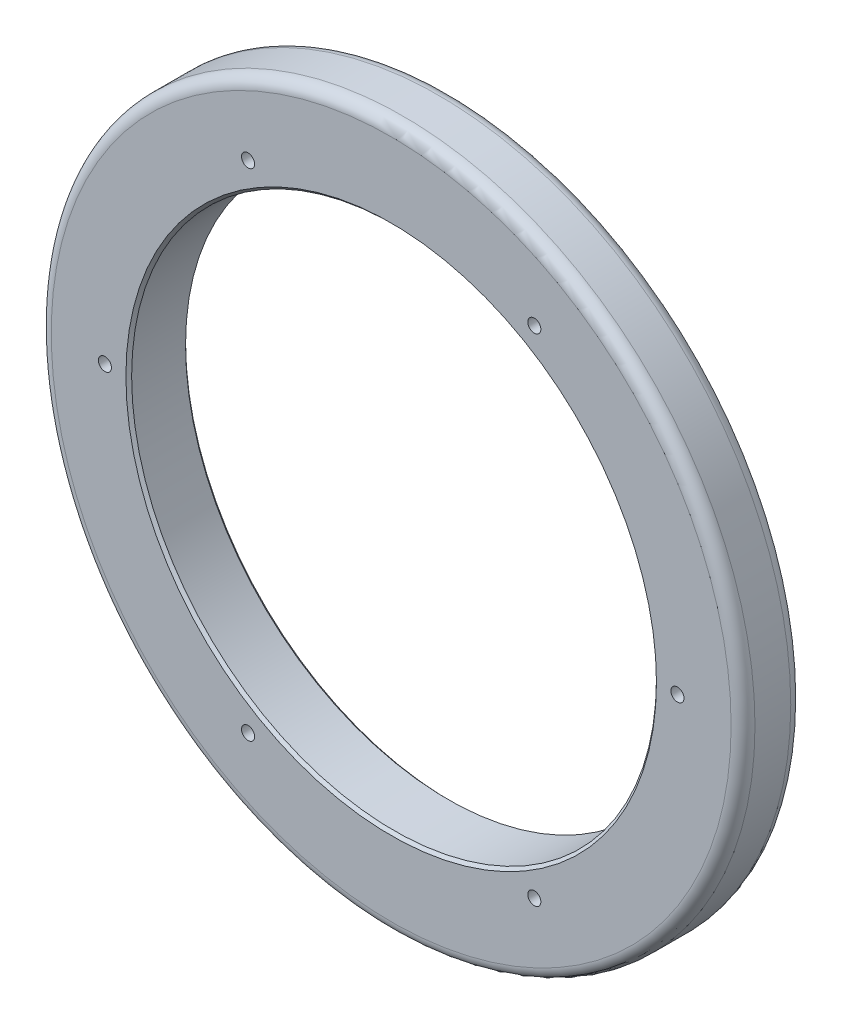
ISO-10303-21;
HEADER;
FILE_DESCRIPTION(('STEP AP214'),'2;1');
FILE_NAME('part.step','',(''),(''),'','','');
FILE_SCHEMA(('AUTOMOTIVE_DESIGN { 1 0 10303 214 1 1 1 1 }'));
ENDSEC;
DATA;
#1=APPLICATION_CONTEXT('core data for automotive mechanical design processes');
#2=APPLICATION_PROTOCOL_DEFINITION('international standard','automotive_design',2000,#1);
#3=PRODUCT_CONTEXT('',#1,'mechanical');
#4=PRODUCT('Part','Part','',(#3));
#5=PRODUCT_RELATED_PRODUCT_CATEGORY('part','',(#4));
#6=PRODUCT_DEFINITION_FORMATION('','',#4);
#7=PRODUCT_DEFINITION_CONTEXT('part definition',#1,'design');
#8=PRODUCT_DEFINITION('design','',#6,#7);
#9=PRODUCT_DEFINITION_SHAPE('','',#8);
#10=(LENGTH_UNIT() NAMED_UNIT(*) SI_UNIT(.MILLI.,.METRE.));
#11=(NAMED_UNIT(*) PLANE_ANGLE_UNIT() SI_UNIT($,.RADIAN.));
#12=(NAMED_UNIT(*) SI_UNIT($,.STERADIAN.) SOLID_ANGLE_UNIT());
#13=UNCERTAINTY_MEASURE_WITH_UNIT(LENGTH_MEASURE(1.E-05),#10,'distance_accuracy_value','');
#14=(GEOMETRIC_REPRESENTATION_CONTEXT(3) GLOBAL_UNCERTAINTY_ASSIGNED_CONTEXT((#13)) GLOBAL_UNIT_ASSIGNED_CONTEXT((#10,
#11,#12)) REPRESENTATION_CONTEXT('',''));
#15=CARTESIAN_POINT('',(0.,0.,0.));
#16=DIRECTION('',(0.,0.,1.));
#17=DIRECTION('',(1.,0.,0.));
#18=AXIS2_PLACEMENT_3D('',#15,#16,#17);
#19=CARTESIAN_POINT('',(0.,0.,15.875));
#20=DIRECTION('',(0.,0.,0.999999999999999));
#21=DIRECTION('',(1.,0.,0.));
#22=AXIS2_PLACEMENT_3D('',#19,#20,#21);
#23=PLANE('',#22);
#24=CARTESIAN_POINT('',(0.,0.,15.875));
#25=DIRECTION('',(0.,0.,0.999999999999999));
#26=DIRECTION('',(1.,0.,0.));
#27=AXIS2_PLACEMENT_3D('',#24,#25,#26);
#28=CIRCLE('',#27,70.612);
#29=CARTESIAN_POINT('',(70.612,0.,15.875));
#30=VERTEX_POINT('',#29);
#31=EDGE_CURVE('E10',#30,#30,#28,.F.);
#32=ORIENTED_EDGE('',*,*,#31,.T.);
#33=EDGE_LOOP('',(#32));
#34=FACE_BOUND('',#33,.T.);
#35=CARTESIAN_POINT('',(-76.2,5.3210206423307E-13,15.875));
#36=DIRECTION('',(0.,0.,0.999999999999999));
#37=DIRECTION('',(1.,0.,0.));
#38=AXIS2_PLACEMENT_3D('',#35,#36,#37);
#39=CIRCLE('',#38,1.7399);
#40=CARTESIAN_POINT('',(-74.4601,5.3210206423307E-13,15.875));
#41=VERTEX_POINT('',#40);
#42=EDGE_CURVE('E96',#41,#41,#39,.T.);
#43=ORIENTED_EDGE('',*,*,#42,.F.);
#44=EDGE_LOOP('',(#43));
#45=FACE_BOUND('',#44,.T.);
#46=CARTESIAN_POINT('',(-38.1000000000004,-65.9911357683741,15.875));
#47=DIRECTION('',(0.,0.,0.999999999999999));
#48=DIRECTION('',(1.,0.,0.));
#49=AXIS2_PLACEMENT_3D('',#46,#47,#48);
#50=CIRCLE('',#49,1.7399);
#51=CARTESIAN_POINT('',(-36.3601000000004,-65.9911357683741,15.875));
#52=VERTEX_POINT('',#51);
#53=EDGE_CURVE('E90',#52,#52,#50,.T.);
#54=ORIENTED_EDGE('',*,*,#53,.F.);
#55=EDGE_LOOP('',(#54));
#56=FACE_BOUND('',#55,.T.);
#57=CARTESIAN_POINT('',(38.0999999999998,-65.9911357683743,15.875));
#58=DIRECTION('',(0.,0.,0.999999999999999));
#59=DIRECTION('',(1.,0.,0.));
#60=AXIS2_PLACEMENT_3D('',#57,#58,#59);
#61=CIRCLE('',#60,1.7399);
#62=CARTESIAN_POINT('',(39.8398999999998,-65.9911357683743,15.875));
#63=VERTEX_POINT('',#62);
#64=EDGE_CURVE('E84',#63,#63,#61,.T.);
#65=ORIENTED_EDGE('',*,*,#64,.F.);
#66=EDGE_LOOP('',(#65));
#67=FACE_BOUND('',#66,.T.);
#68=CARTESIAN_POINT('',(38.1000000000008,65.9911357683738,15.875));
#69=DIRECTION('',(0.,0.,0.999999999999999));
#70=DIRECTION('',(1.,0.,0.));
#71=AXIS2_PLACEMENT_3D('',#68,#69,#70);
#72=CIRCLE('',#71,1.7399);
#73=CARTESIAN_POINT('',(39.8399000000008,65.9911357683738,15.875));
#74=VERTEX_POINT('',#73);
#75=EDGE_CURVE('E78',#74,#74,#72,.T.);
#76=ORIENTED_EDGE('',*,*,#75,.F.);
#77=EDGE_LOOP('',(#76));
#78=FACE_BOUND('',#77,.T.);
#79=CARTESIAN_POINT('',(76.2,0.,15.875));
#80=DIRECTION('',(0.,0.,0.999999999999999));
#81=DIRECTION('',(1.,0.,0.));
#82=AXIS2_PLACEMENT_3D('',#79,#80,#81);
#83=CIRCLE('',#82,1.7399);
#84=CARTESIAN_POINT('',(77.9399,0.,15.875));
#85=VERTEX_POINT('',#84);
#86=EDGE_CURVE('E72',#85,#85,#83,.T.);
#87=ORIENTED_EDGE('',*,*,#86,.F.);
#88=EDGE_LOOP('',(#87));
#89=FACE_BOUND('',#88,.T.);
#90=CARTESIAN_POINT('',(-38.0999999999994,65.9911357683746,15.875));
#91=DIRECTION('',(0.,0.,0.999999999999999));
#92=DIRECTION('',(1.,0.,0.));
#93=AXIS2_PLACEMENT_3D('',#90,#91,#92);
#94=CIRCLE('',#93,1.7399);
#95=CARTESIAN_POINT('',(-36.3600999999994,65.9911357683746,15.875));
#96=VERTEX_POINT('',#95);
#97=EDGE_CURVE('E66',#96,#96,#94,.T.);
#98=ORIENTED_EDGE('',*,*,#97,.F.);
#99=EDGE_LOOP('',(#98));
#100=FACE_BOUND('',#99,.T.);
#101=CARTESIAN_POINT('',(0.,0.,15.875));
#102=DIRECTION('',(0.,0.,0.999999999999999));
#103=DIRECTION('',(1.,0.,0.));
#104=AXIS2_PLACEMENT_3D('',#101,#102,#103);
#105=CIRCLE('',#104,90.4875);
#106=CARTESIAN_POINT('',(90.4875,0.,15.875));
#107=VERTEX_POINT('',#106);
#108=EDGE_CURVE('E51',#107,#107,#105,.T.);
#109=ORIENTED_EDGE('',*,*,#108,.T.);
#110=EDGE_LOOP('',(#109));
#111=FACE_BOUND('',#110,.T.);
#112=ADVANCED_FACE('F31',(#34,#45,#56,#67,#78,#89,#100,#111),#23,.T.);
#113=CARTESIAN_POINT('',(0.,0.,0.));
#114=DIRECTION('',(0.,0.,0.999999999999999));
#115=DIRECTION('',(1.,0.,0.));
#116=AXIS2_PLACEMENT_3D('',#113,#114,#115);
#117=PLANE('',#116);
#118=CARTESIAN_POINT('',(0.,0.,0.));
#119=DIRECTION('',(0.,0.,0.999999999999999));
#120=DIRECTION('',(1.,0.,0.));
#121=AXIS2_PLACEMENT_3D('',#118,#119,#120);
#122=CIRCLE('',#121,70.612);
#123=CARTESIAN_POINT('',(-70.612,0.,0.));
#124=VERTEX_POINT('',#123);
#125=EDGE_CURVE('E46',#124,#124,#122,.T.);
#126=ORIENTED_EDGE('',*,*,#125,.T.);
#127=EDGE_LOOP('',(#126));
#128=FACE_BOUND('',#127,.T.);
#129=CARTESIAN_POINT('',(-76.2,5.3210206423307E-13,0.));
#130=DIRECTION('',(0.,0.,0.999999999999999));
#131=DIRECTION('',(1.,0.,0.));
#132=AXIS2_PLACEMENT_3D('',#129,#130,#131);
#133=CIRCLE('',#132,1.7399);
#134=CARTESIAN_POINT('',(-74.4601,5.3210206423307E-13,0.));
#135=VERTEX_POINT('',#134);
#136=EDGE_CURVE('E93',#135,#135,#133,.T.);
#137=ORIENTED_EDGE('',*,*,#136,.T.);
#138=EDGE_LOOP('',(#137));
#139=FACE_BOUND('',#138,.T.);
#140=CARTESIAN_POINT('',(-38.1000000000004,-65.9911357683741,0.));
#141=DIRECTION('',(0.,0.,0.999999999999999));
#142=DIRECTION('',(1.,0.,0.));
#143=AXIS2_PLACEMENT_3D('',#140,#141,#142);
#144=CIRCLE('',#143,1.7399);
#145=CARTESIAN_POINT('',(-36.3601000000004,-65.9911357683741,0.));
#146=VERTEX_POINT('',#145);
#147=EDGE_CURVE('E87',#146,#146,#144,.T.);
#148=ORIENTED_EDGE('',*,*,#147,.T.);
#149=EDGE_LOOP('',(#148));
#150=FACE_BOUND('',#149,.T.);
#151=CARTESIAN_POINT('',(38.0999999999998,-65.9911357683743,0.));
#152=DIRECTION('',(0.,0.,0.999999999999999));
#153=DIRECTION('',(1.,0.,0.));
#154=AXIS2_PLACEMENT_3D('',#151,#152,#153);
#155=CIRCLE('',#154,1.7399);
#156=CARTESIAN_POINT('',(39.8398999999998,-65.9911357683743,0.));
#157=VERTEX_POINT('',#156);
#158=EDGE_CURVE('E81',#157,#157,#155,.T.);
#159=ORIENTED_EDGE('',*,*,#158,.T.);
#160=EDGE_LOOP('',(#159));
#161=FACE_BOUND('',#160,.T.);
#162=CARTESIAN_POINT('',(38.1000000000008,65.9911357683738,0.));
#163=DIRECTION('',(0.,0.,0.999999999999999));
#164=DIRECTION('',(1.,0.,0.));
#165=AXIS2_PLACEMENT_3D('',#162,#163,#164);
#166=CIRCLE('',#165,1.7399);
#167=CARTESIAN_POINT('',(39.8399000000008,65.9911357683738,0.));
#168=VERTEX_POINT('',#167);
#169=EDGE_CURVE('E75',#168,#168,#166,.T.);
#170=ORIENTED_EDGE('',*,*,#169,.T.);
#171=EDGE_LOOP('',(#170));
#172=FACE_BOUND('',#171,.T.);
#173=CARTESIAN_POINT('',(76.2,0.,0.));
#174=DIRECTION('',(0.,0.,0.999999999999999));
#175=DIRECTION('',(1.,0.,0.));
#176=AXIS2_PLACEMENT_3D('',#173,#174,#175);
#177=CIRCLE('',#176,1.7399);
#178=CARTESIAN_POINT('',(77.9399,0.,0.));
#179=VERTEX_POINT('',#178);
#180=EDGE_CURVE('E69',#179,#179,#177,.T.);
#181=ORIENTED_EDGE('',*,*,#180,.T.);
#182=EDGE_LOOP('',(#181));
#183=FACE_BOUND('',#182,.T.);
#184=CARTESIAN_POINT('',(-38.0999999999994,65.9911357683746,0.));
#185=DIRECTION('',(0.,0.,0.999999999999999));
#186=DIRECTION('',(1.,0.,0.));
#187=AXIS2_PLACEMENT_3D('',#184,#185,#186);
#188=CIRCLE('',#187,1.7399);
#189=CARTESIAN_POINT('',(-36.3600999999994,65.9911357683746,0.));
#190=VERTEX_POINT('',#189);
#191=EDGE_CURVE('E63',#190,#190,#188,.T.);
#192=ORIENTED_EDGE('',*,*,#191,.T.);
#193=EDGE_LOOP('',(#192));
#194=FACE_BOUND('',#193,.T.);
#195=CARTESIAN_POINT('',(0.,0.,0.));
#196=DIRECTION('',(0.,0.,0.999999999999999));
#197=DIRECTION('',(1.,0.,0.));
#198=AXIS2_PLACEMENT_3D('',#195,#196,#197);
#199=CIRCLE('',#198,90.4875);
#200=CARTESIAN_POINT('',(90.4875,0.,0.));
#201=VERTEX_POINT('',#200);
#202=EDGE_CURVE('E54',#201,#201,#199,.F.);
#203=ORIENTED_EDGE('',*,*,#202,.T.);
#204=EDGE_LOOP('',(#203));
#205=FACE_BOUND('',#204,.T.);
#206=ADVANCED_FACE('F104',(#128,#139,#150,#161,#172,#183,#194,#205),#117,.F.);
#207=CARTESIAN_POINT('',(0.,0.,15.875));
#208=DIRECTION('',(0.,0.,-0.999999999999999));
#209=DIRECTION('',(-1.,0.,0.));
#210=AXIS2_PLACEMENT_3D('',#207,#208,#209);
#211=CYLINDRICAL_SURFACE('',#210,93.6625);
#212=CARTESIAN_POINT('',(0.,0.,3.17500000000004));
#213=DIRECTION('',(0.,0.,0.999999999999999));
#214=DIRECTION('',(1.,0.,0.));
#215=AXIS2_PLACEMENT_3D('',#212,#213,#214);
#216=CIRCLE('',#215,93.6625);
#217=CARTESIAN_POINT('',(-93.6625,0.,3.17500000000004));
#218=VERTEX_POINT('',#217);
#219=EDGE_CURVE('E57',#218,#218,#216,.T.);
#220=CARTESIAN_POINT('',(0.,0.,12.7));
#221=DIRECTION('',(0.,0.,0.999999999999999));
#222=DIRECTION('',(1.,0.,0.));
#223=AXIS2_PLACEMENT_3D('',#220,#221,#222);
#224=CIRCLE('',#223,93.6625);
#225=CARTESIAN_POINT('',(-93.6625,0.,12.7));
#226=VERTEX_POINT('',#225);
#227=EDGE_CURVE('E60',#226,#226,#224,.F.);
#228=CARTESIAN_POINT('',(-93.6625,0.,3.17500000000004));
#229=CARTESIAN_POINT('',(-93.6625,0.,3.27421875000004));
#230=CARTESIAN_POINT('',(-93.6625,0.,3.37343750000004));
#231=CARTESIAN_POINT('',(-93.6625,0.,3.57187500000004));
#232=CARTESIAN_POINT('',(-93.6625,0.,3.67109375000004));
#233=CARTESIAN_POINT('',(-93.6625,0.,3.86953125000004));
#234=CARTESIAN_POINT('',(-93.6625,0.,3.96875000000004));
#235=CARTESIAN_POINT('',(-93.6625,0.,4.16718750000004));
#236=CARTESIAN_POINT('',(-93.6625,0.,4.26640625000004));
#237=CARTESIAN_POINT('',(-93.6625,0.,4.46484375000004));
#238=CARTESIAN_POINT('',(-93.6625,0.,4.56406250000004));
#239=CARTESIAN_POINT('',(-93.6625,0.,4.76250000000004));
#240=CARTESIAN_POINT('',(-93.6625,0.,4.86171875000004));
#241=CARTESIAN_POINT('',(-93.6625,0.,5.06015625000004));
#242=CARTESIAN_POINT('',(-93.6625,0.,5.15937500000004));
#243=CARTESIAN_POINT('',(-93.6625,0.,5.35781250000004));
#244=CARTESIAN_POINT('',(-93.6625,0.,5.45703125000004));
#245=CARTESIAN_POINT('',(-93.6625,0.,5.65546875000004));
#246=CARTESIAN_POINT('',(-93.6625,0.,5.75468750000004));
#247=CARTESIAN_POINT('',(-93.6625,0.,5.95312500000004));
#248=CARTESIAN_POINT('',(-93.6625,0.,6.05234375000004));
#249=CARTESIAN_POINT('',(-93.6625,0.,6.25078125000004));
#250=CARTESIAN_POINT('',(-93.6625,0.,6.35000000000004));
#251=CARTESIAN_POINT('',(-93.6625,0.,6.54843750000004));
#252=CARTESIAN_POINT('',(-93.6625,0.,6.64765625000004));
#253=CARTESIAN_POINT('',(-93.6625,0.,6.84609375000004));
#254=CARTESIAN_POINT('',(-93.6625,0.,6.94531250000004));
#255=CARTESIAN_POINT('',(-93.6625,0.,7.14375000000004));
#256=CARTESIAN_POINT('',(-93.6625,0.,7.24296875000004));
#257=CARTESIAN_POINT('',(-93.6625,0.,7.44140625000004));
#258=CARTESIAN_POINT('',(-93.6625,0.,7.54062500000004));
#259=CARTESIAN_POINT('',(-93.6625,0.,7.73906250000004));
#260=CARTESIAN_POINT('',(-93.6625,0.,7.83828125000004));
#261=CARTESIAN_POINT('',(-93.6625,0.,8.03671875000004));
#262=CARTESIAN_POINT('',(-93.6625,0.,8.13593750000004));
#263=CARTESIAN_POINT('',(-93.6625,0.,8.33437500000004));
#264=CARTESIAN_POINT('',(-93.6625,0.,8.43359375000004));
#265=CARTESIAN_POINT('',(-93.6625,0.,8.63203125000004));
#266=CARTESIAN_POINT('',(-93.6625,0.,8.73125000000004));
#267=CARTESIAN_POINT('',(-93.6625,0.,8.92968750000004));
#268=CARTESIAN_POINT('',(-93.6625,0.,9.02890625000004));
#269=CARTESIAN_POINT('',(-93.6625,0.,9.22734375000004));
#270=CARTESIAN_POINT('',(-93.6625,0.,9.32656250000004));
#271=CARTESIAN_POINT('',(-93.6625,0.,9.52500000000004));
#272=CARTESIAN_POINT('',(-93.6625,0.,9.62421875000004));
#273=CARTESIAN_POINT('',(-93.6625,0.,9.82265625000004));
#274=CARTESIAN_POINT('',(-93.6625,0.,9.92187500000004));
#275=CARTESIAN_POINT('',(-93.6625,0.,10.1203125));
#276=CARTESIAN_POINT('',(-93.6625,0.,10.21953125));
#277=CARTESIAN_POINT('',(-93.6625,0.,10.41796875));
#278=CARTESIAN_POINT('',(-93.6625,0.,10.5171875));
#279=CARTESIAN_POINT('',(-93.6625,0.,10.715625));
#280=CARTESIAN_POINT('',(-93.6625,0.,10.81484375));
#281=CARTESIAN_POINT('',(-93.6625,0.,11.01328125));
#282=CARTESIAN_POINT('',(-93.6625,0.,11.1125));
#283=CARTESIAN_POINT('',(-93.6625,0.,11.3109375));
#284=CARTESIAN_POINT('',(-93.6625,0.,11.41015625));
#285=CARTESIAN_POINT('',(-93.6625,0.,11.60859375));
#286=CARTESIAN_POINT('',(-93.6625,0.,11.7078125));
#287=CARTESIAN_POINT('',(-93.6625,0.,11.90625));
#288=CARTESIAN_POINT('',(-93.6625,0.,12.00546875));
#289=CARTESIAN_POINT('',(-93.6625,0.,12.20390625));
#290=CARTESIAN_POINT('',(-93.6625,0.,12.303125));
#291=CARTESIAN_POINT('',(-93.6625,0.,12.5015625));
#292=CARTESIAN_POINT('',(-93.6625,0.,12.60078125));
#293=CARTESIAN_POINT('',(-93.6625,0.,12.7));
#294=B_SPLINE_CURVE_WITH_KNOTS('',3,(#228,#229,#230,#231,#232,#233,#234,#235,#236,#237,#238,
#239,#240,#241,#242,#243,#244,#245,#246,#247,#248,#249,#250,#251,#252,#253,#254,#255,#256,#257,
#258,#259,#260,#261,#262,#263,#264,#265,#266,#267,#268,#269,#270,#271,#272,#273,#274,#275,#276,
#277,#278,#279,#280,#281,#282,#283,#284,#285,#286,#287,#288,#289,#290,#291,#292,#293),
.UNSPECIFIED.,.F.,.F.,(4,2,2,2,2,2,2,2,2,2,2,2,2,2,2,2,2,2,2,2,2,2,2,2,2,2,2,2,2,2,2,2,4),(0.,
0.29765625,0.595312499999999,0.892968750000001,1.190625,1.48828125,1.7859375,2.08359375,2.38125,
2.67890625,2.9765625,3.27421875,3.571875,3.86953125,4.1671875,4.46484375,4.7625,5.06015625,
5.3578125,5.65546875,5.953125,6.25078125,6.5484375,6.84609375,7.14375,7.44140625,7.7390625,
8.03671875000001,8.334375,8.63203125,8.92968750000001,9.22734375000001,9.52500000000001),.UNSPECIFIED.);
#295=EDGE_CURVE('BSEAM33',#218,#226,#294,.T.);
#296=ORIENTED_EDGE('',*,*,#219,.T.);
#297=ORIENTED_EDGE('',*,*,#227,.T.);
#298=ORIENTED_EDGE('',*,*,#295,.T.);
#299=ORIENTED_EDGE('',*,*,#295,.F.);
#300=EDGE_LOOP('',(#296,#298,#297,#299));
#301=FACE_BOUND('',#300,.T.);
#302=ADVANCED_FACE('F33',(#301),#211,.T.);
#303=CARTESIAN_POINT('',(0.,0.,15.875));
#304=DIRECTION('',(0.,0.,-0.999999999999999));
#305=DIRECTION('',(-1.,0.,0.));
#306=AXIS2_PLACEMENT_3D('',#303,#304,#305);
#307=CYLINDRICAL_SURFACE('',#306,69.85);
#308=CARTESIAN_POINT('',(0.,0.,0.76200000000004));
#309=DIRECTION('',(0.,0.,0.999999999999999));
#310=DIRECTION('',(1.,0.,0.));
#311=AXIS2_PLACEMENT_3D('',#308,#309,#310);
#312=CIRCLE('',#311,69.85);
#313=CARTESIAN_POINT('',(-69.85,0.,0.76200000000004));
#314=VERTEX_POINT('',#313);
#315=EDGE_CURVE('E38',#314,#314,#312,.F.);
#316=CARTESIAN_POINT('',(0.,0.,15.113));
#317=DIRECTION('',(0.,0.,0.999999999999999));
#318=DIRECTION('',(1.,0.,0.));
#319=AXIS2_PLACEMENT_3D('',#316,#317,#318);
#320=CIRCLE('',#319,69.85);
#321=CARTESIAN_POINT('',(-69.85,0.,15.113));
#322=VERTEX_POINT('',#321);
#323=EDGE_CURVE('E42',#322,#322,#320,.T.);
#324=CARTESIAN_POINT('',(-69.85,0.,0.76200000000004));
#325=CARTESIAN_POINT('',(-69.85,0.,0.911489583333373));
#326=CARTESIAN_POINT('',(-69.85,0.,1.06097916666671));
#327=CARTESIAN_POINT('',(-69.85,0.,1.35995833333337));
#328=CARTESIAN_POINT('',(-69.85,0.,1.50944791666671));
#329=CARTESIAN_POINT('',(-69.85,0.,1.80842708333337));
#330=CARTESIAN_POINT('',(-69.85,0.,1.95791666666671));
#331=CARTESIAN_POINT('',(-69.85,0.,2.25689583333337));
#332=CARTESIAN_POINT('',(-69.85,0.,2.40638541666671));
#333=CARTESIAN_POINT('',(-69.85,0.,2.70536458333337));
#334=CARTESIAN_POINT('',(-69.85,0.,2.85485416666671));
#335=CARTESIAN_POINT('',(-69.85,0.,3.15383333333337));
#336=CARTESIAN_POINT('',(-69.85,0.,3.30332291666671));
#337=CARTESIAN_POINT('',(-69.85,0.,3.60230208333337));
#338=CARTESIAN_POINT('',(-69.85,0.,3.75179166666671));
#339=CARTESIAN_POINT('',(-69.85,0.,4.05077083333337));
#340=CARTESIAN_POINT('',(-69.85,0.,4.20026041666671));
#341=CARTESIAN_POINT('',(-69.85,0.,4.49923958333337));
#342=CARTESIAN_POINT('',(-69.85,0.,4.64872916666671));
#343=CARTESIAN_POINT('',(-69.85,0.,4.94770833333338));
#344=CARTESIAN_POINT('',(-69.85,0.,5.09719791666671));
#345=CARTESIAN_POINT('',(-69.85,0.,5.39617708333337));
#346=CARTESIAN_POINT('',(-69.85,0.,5.54566666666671));
#347=CARTESIAN_POINT('',(-69.85,0.,5.84464583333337));
#348=CARTESIAN_POINT('',(-69.85,0.,5.99413541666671));
#349=CARTESIAN_POINT('',(-69.85,0.,6.29311458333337));
#350=CARTESIAN_POINT('',(-69.85,0.,6.44260416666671));
#351=CARTESIAN_POINT('',(-69.85,0.,6.74158333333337));
#352=CARTESIAN_POINT('',(-69.85,0.,6.89107291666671));
#353=CARTESIAN_POINT('',(-69.85,0.,7.19005208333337));
#354=CARTESIAN_POINT('',(-69.85,0.,7.33954166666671));
#355=CARTESIAN_POINT('',(-69.85,0.,7.63852083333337));
#356=CARTESIAN_POINT('',(-69.85,0.,7.78801041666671));
#357=CARTESIAN_POINT('',(-69.85,0.,8.08698958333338));
#358=CARTESIAN_POINT('',(-69.85,0.,8.23647916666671));
#359=CARTESIAN_POINT('',(-69.85,0.,8.53545833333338));
#360=CARTESIAN_POINT('',(-69.85,0.,8.68494791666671));
#361=CARTESIAN_POINT('',(-69.85,0.,8.98392708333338));
#362=CARTESIAN_POINT('',(-69.85,0.,9.13341666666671));
#363=CARTESIAN_POINT('',(-69.85,0.,9.43239583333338));
#364=CARTESIAN_POINT('',(-69.85,0.,9.58188541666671));
#365=CARTESIAN_POINT('',(-69.85,0.,9.88086458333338));
#366=CARTESIAN_POINT('',(-69.85,0.,10.0303541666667));
#367=CARTESIAN_POINT('',(-69.85,0.,10.3293333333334));
#368=CARTESIAN_POINT('',(-69.85,0.,10.4788229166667));
#369=CARTESIAN_POINT('',(-69.85,0.,10.7778020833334));
#370=CARTESIAN_POINT('',(-69.85,0.,10.9272916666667));
#371=CARTESIAN_POINT('',(-69.85,0.,11.2262708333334));
#372=CARTESIAN_POINT('',(-69.85,0.,11.3757604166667));
#373=CARTESIAN_POINT('',(-69.85,0.,11.6747395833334));
#374=CARTESIAN_POINT('',(-69.85,0.,11.8242291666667));
#375=CARTESIAN_POINT('',(-69.85,0.,12.1232083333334));
#376=CARTESIAN_POINT('',(-69.85,0.,12.2726979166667));
#377=CARTESIAN_POINT('',(-69.85,0.,12.5716770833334));
#378=CARTESIAN_POINT('',(-69.85,0.,12.7211666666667));
#379=CARTESIAN_POINT('',(-69.85,0.,13.0201458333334));
#380=CARTESIAN_POINT('',(-69.85,0.,13.1696354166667));
#381=CARTESIAN_POINT('',(-69.85,0.,13.4686145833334));
#382=CARTESIAN_POINT('',(-69.85,0.,13.6181041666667));
#383=CARTESIAN_POINT('',(-69.85,0.,13.9170833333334));
#384=CARTESIAN_POINT('',(-69.85,0.,14.0665729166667));
#385=CARTESIAN_POINT('',(-69.85,0.,14.3655520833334));
#386=CARTESIAN_POINT('',(-69.85,0.,14.5150416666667));
#387=CARTESIAN_POINT('',(-69.85,0.,14.8140208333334));
#388=CARTESIAN_POINT('',(-69.85,0.,14.9635104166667));
#389=CARTESIAN_POINT('',(-69.85,0.,15.113));
#390=B_SPLINE_CURVE_WITH_KNOTS('',3,(#324,#325,#326,#327,#328,#329,#330,#331,#332,#333,#334,
#335,#336,#337,#338,#339,#340,#341,#342,#343,#344,#345,#346,#347,#348,#349,#350,#351,#352,#353,
#354,#355,#356,#357,#358,#359,#360,#361,#362,#363,#364,#365,#366,#367,#368,#369,#370,#371,#372,
#373,#374,#375,#376,#377,#378,#379,#380,#381,#382,#383,#384,#385,#386,#387,#388,#389),
.UNSPECIFIED.,.F.,.F.,(4,2,2,2,2,2,2,2,2,2,2,2,2,2,2,2,2,2,2,2,2,2,2,2,2,2,2,2,2,2,2,2,4),(0.,
0.448468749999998,0.8969375,1.34540625,1.793875,2.24234375,2.6908125,3.13928125,3.58775,
4.03621875,4.4846875,4.93315625,5.381625,5.83009375,6.2785625,6.72703125,7.1755,7.62396875,
8.0724375,8.52090625,8.969375,9.41784375,9.8663125,10.31478125,10.76325,11.21171875,11.6601875,
12.10865625,12.557125,13.00559375,13.4540625,13.90253125,14.351),.UNSPECIFIED.);
#391=EDGE_CURVE('BSEAM130',#314,#322,#390,.T.);
#392=ORIENTED_EDGE('',*,*,#315,.T.);
#393=ORIENTED_EDGE('',*,*,#323,.T.);
#394=ORIENTED_EDGE('',*,*,#391,.T.);
#395=ORIENTED_EDGE('',*,*,#391,.F.);
#396=EDGE_LOOP('',(#392,#394,#393,#395));
#397=FACE_BOUND('',#396,.T.);
#398=ADVANCED_FACE('F130',(#397),#307,.F.);
#399=CARTESIAN_POINT('',(0.,0.,3.17500000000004));
#400=DIRECTION('',(0.,0.,0.999999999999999));
#401=DIRECTION('',(1.,0.,0.));
#402=AXIS2_PLACEMENT_3D('',#399,#400,#401);
#403=TOROIDAL_SURFACE('',#402,90.4875,3.175);
#404=ORIENTED_EDGE('',*,*,#202,.F.);
#405=EDGE_LOOP('',(#404));
#406=FACE_BOUND('',#405,.T.);
#407=ORIENTED_EDGE('',*,*,#219,.F.);
#408=EDGE_LOOP('',(#407));
#409=FACE_BOUND('',#408,.T.);
#410=ADVANCED_FACE('F120',(#406,#409),#403,.T.);
#411=CARTESIAN_POINT('',(0.,0.,12.7));
#412=DIRECTION('',(0.,0.,0.999999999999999));
#413=DIRECTION('',(1.,0.,0.));
#414=AXIS2_PLACEMENT_3D('',#411,#412,#413);
#415=TOROIDAL_SURFACE('',#414,90.4875,3.175);
#416=ORIENTED_EDGE('',*,*,#227,.F.);
#417=EDGE_LOOP('',(#416));
#418=FACE_BOUND('',#417,.T.);
#419=ORIENTED_EDGE('',*,*,#108,.F.);
#420=EDGE_LOOP('',(#419));
#421=FACE_BOUND('',#420,.T.);
#422=ADVANCED_FACE('F117',(#418,#421),#415,.T.);
#423=CARTESIAN_POINT('',(-38.0999999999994,65.9911357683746,0.));
#424=DIRECTION('',(0.,0.,0.999999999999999));
#425=DIRECTION('',(1.,0.,0.));
#426=AXIS2_PLACEMENT_3D('',#423,#424,#425);
#427=CYLINDRICAL_SURFACE('',#426,1.7399);
#428=CARTESIAN_POINT('',(-36.3600999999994,65.9911357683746,0.));
#429=CARTESIAN_POINT('',(-36.3600999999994,65.9911357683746,0.165364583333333));
#430=CARTESIAN_POINT('',(-36.3600999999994,65.9911357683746,0.330729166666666));
#431=CARTESIAN_POINT('',(-36.3600999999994,65.9911357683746,0.661458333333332));
#432=CARTESIAN_POINT('',(-36.3600999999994,65.9911357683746,0.826822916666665));
#433=CARTESIAN_POINT('',(-36.3600999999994,65.9911357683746,1.15755208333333));
#434=CARTESIAN_POINT('',(-36.3600999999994,65.9911357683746,1.32291666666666));
#435=CARTESIAN_POINT('',(-36.3600999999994,65.9911357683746,1.65364583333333));
#436=CARTESIAN_POINT('',(-36.3600999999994,65.9911357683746,1.81901041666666));
#437=CARTESIAN_POINT('',(-36.3600999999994,65.9911357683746,2.14973958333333));
#438=CARTESIAN_POINT('',(-36.3600999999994,65.9911357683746,2.31510416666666));
#439=CARTESIAN_POINT('',(-36.3600999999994,65.9911357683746,2.64583333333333));
#440=CARTESIAN_POINT('',(-36.3600999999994,65.9911357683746,2.81119791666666));
#441=CARTESIAN_POINT('',(-36.3600999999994,65.9911357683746,3.14192708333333));
#442=CARTESIAN_POINT('',(-36.3600999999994,65.9911357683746,3.30729166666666));
#443=CARTESIAN_POINT('',(-36.3600999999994,65.9911357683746,3.63802083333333));
#444=CARTESIAN_POINT('',(-36.3600999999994,65.9911357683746,3.80338541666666));
#445=CARTESIAN_POINT('',(-36.3600999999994,65.9911357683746,4.13411458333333));
#446=CARTESIAN_POINT('',(-36.3600999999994,65.9911357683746,4.29947916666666));
#447=CARTESIAN_POINT('',(-36.3600999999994,65.9911357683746,4.63020833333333));
#448=CARTESIAN_POINT('',(-36.3600999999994,65.9911357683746,4.79557291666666));
#449=CARTESIAN_POINT('',(-36.3600999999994,65.9911357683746,5.12630208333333));
#450=CARTESIAN_POINT('',(-36.3600999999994,65.9911357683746,5.29166666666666));
#451=CARTESIAN_POINT('',(-36.3600999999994,65.9911357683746,5.62239583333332));
#452=CARTESIAN_POINT('',(-36.3600999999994,65.9911357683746,5.78776041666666));
#453=CARTESIAN_POINT('',(-36.3600999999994,65.9911357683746,6.11848958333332));
#454=CARTESIAN_POINT('',(-36.3600999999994,65.9911357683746,6.28385416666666));
#455=CARTESIAN_POINT('',(-36.3600999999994,65.9911357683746,6.61458333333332));
#456=CARTESIAN_POINT('',(-36.3600999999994,65.9911357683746,6.77994791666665));
#457=CARTESIAN_POINT('',(-36.3600999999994,65.9911357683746,7.11067708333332));
#458=CARTESIAN_POINT('',(-36.3600999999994,65.9911357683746,7.27604166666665));
#459=CARTESIAN_POINT('',(-36.3600999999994,65.9911357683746,7.60677083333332));
#460=CARTESIAN_POINT('',(-36.3600999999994,65.9911357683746,7.77213541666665));
#461=CARTESIAN_POINT('',(-36.3600999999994,65.9911357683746,8.10286458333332));
#462=CARTESIAN_POINT('',(-36.3600999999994,65.9911357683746,8.26822916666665));
#463=CARTESIAN_POINT('',(-36.3600999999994,65.9911357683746,8.59895833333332));
#464=CARTESIAN_POINT('',(-36.3600999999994,65.9911357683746,8.76432291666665));
#465=CARTESIAN_POINT('',(-36.3600999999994,65.9911357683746,9.09505208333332));
#466=CARTESIAN_POINT('',(-36.3600999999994,65.9911357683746,9.26041666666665));
#467=CARTESIAN_POINT('',(-36.3600999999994,65.9911357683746,9.59114583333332));
#468=CARTESIAN_POINT('',(-36.3600999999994,65.9911357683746,9.75651041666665));
#469=CARTESIAN_POINT('',(-36.3600999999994,65.9911357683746,10.0872395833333));
#470=CARTESIAN_POINT('',(-36.3600999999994,65.9911357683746,10.2526041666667));
#471=CARTESIAN_POINT('',(-36.3600999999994,65.9911357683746,10.5833333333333));
#472=CARTESIAN_POINT('',(-36.3600999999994,65.9911357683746,10.7486979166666));
#473=CARTESIAN_POINT('',(-36.3600999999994,65.9911357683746,11.0794270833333));
#474=CARTESIAN_POINT('',(-36.3600999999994,65.9911357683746,11.2447916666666));
#475=CARTESIAN_POINT('',(-36.3600999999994,65.9911357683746,11.5755208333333));
#476=CARTESIAN_POINT('',(-36.3600999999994,65.9911357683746,11.7408854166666));
#477=CARTESIAN_POINT('',(-36.3600999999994,65.9911357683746,12.0716145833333));
#478=CARTESIAN_POINT('',(-36.3600999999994,65.9911357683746,12.2369791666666));
#479=CARTESIAN_POINT('',(-36.3600999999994,65.9911357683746,12.5677083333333));
#480=CARTESIAN_POINT('',(-36.3600999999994,65.9911357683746,12.7330729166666));
#481=CARTESIAN_POINT('',(-36.3600999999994,65.9911357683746,13.0638020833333));
#482=CARTESIAN_POINT('',(-36.3600999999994,65.9911357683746,13.2291666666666));
#483=CARTESIAN_POINT('',(-36.3600999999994,65.9911357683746,13.5598958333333));
#484=CARTESIAN_POINT('',(-36.3600999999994,65.9911357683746,13.7252604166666));
#485=CARTESIAN_POINT('',(-36.3600999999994,65.9911357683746,14.0559895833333));
#486=CARTESIAN_POINT('',(-36.3600999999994,65.9911357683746,14.2213541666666));
#487=CARTESIAN_POINT('',(-36.3600999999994,65.9911357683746,14.5520833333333));
#488=CARTESIAN_POINT('',(-36.3600999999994,65.9911357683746,14.7174479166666));
#489=CARTESIAN_POINT('',(-36.3600999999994,65.9911357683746,15.0481770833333));
#490=CARTESIAN_POINT('',(-36.3600999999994,65.9911357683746,15.2135416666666));
#491=CARTESIAN_POINT('',(-36.3600999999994,65.9911357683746,15.5442708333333));
#492=CARTESIAN_POINT('',(-36.3600999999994,65.9911357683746,15.7096354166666));
#493=CARTESIAN_POINT('',(-36.3600999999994,65.9911357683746,15.875));
#494=B_SPLINE_CURVE_WITH_KNOTS('',3,(#428,#429,#430,#431,#432,#433,#434,#435,#436,#437,#438,
#439,#440,#441,#442,#443,#444,#445,#446,#447,#448,#449,#450,#451,#452,#453,#454,#455,#456,#457,
#458,#459,#460,#461,#462,#463,#464,#465,#466,#467,#468,#469,#470,#471,#472,#473,#474,#475,#476,
#477,#478,#479,#480,#481,#482,#483,#484,#485,#486,#487,#488,#489,#490,#491,#492,#493),
.UNSPECIFIED.,.F.,.F.,(4,2,2,2,2,2,2,2,2,2,2,2,2,2,2,2,2,2,2,2,2,2,2,2,2,2,2,2,2,2,2,2,4),(0.,
0.496093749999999,0.992187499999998,1.48828125,1.984375,2.48046875,2.97656249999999,
3.47265624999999,3.96874999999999,4.46484374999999,4.96093749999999,5.45703124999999,
5.95312499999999,6.44921874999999,6.94531249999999,7.44140624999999,7.93749999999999,
8.43359374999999,8.92968749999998,9.42578124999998,9.92187499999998,10.41796875,10.9140625,
11.41015625,11.90625,12.40234375,12.8984375,13.39453125,13.890625,14.38671875,14.8828125,
15.37890625,15.875),.UNSPECIFIED.);
#495=EDGE_CURVE('BSEAM119',#190,#96,#494,.T.);
#496=ORIENTED_EDGE('',*,*,#191,.F.);
#497=ORIENTED_EDGE('',*,*,#97,.T.);
#498=ORIENTED_EDGE('',*,*,#495,.T.);
#499=ORIENTED_EDGE('',*,*,#495,.F.);
#500=EDGE_LOOP('',(#496,#498,#497,#499));
#501=FACE_BOUND('',#500,.T.);
#502=ADVANCED_FACE('F119',(#501),#427,.F.);
#503=CARTESIAN_POINT('',(76.2,0.,0.));
#504=DIRECTION('',(0.,0.,0.999999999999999));
#505=DIRECTION('',(1.,0.,0.));
#506=AXIS2_PLACEMENT_3D('',#503,#504,#505);
#507=CYLINDRICAL_SURFACE('',#506,1.7399);
#508=CARTESIAN_POINT('',(77.9399,0.,0.));
#509=CARTESIAN_POINT('',(77.9399,0.,0.165364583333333));
#510=CARTESIAN_POINT('',(77.9399,0.,0.330729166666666));
#511=CARTESIAN_POINT('',(77.9399,0.,0.661458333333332));
#512=CARTESIAN_POINT('',(77.9399,0.,0.826822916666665));
#513=CARTESIAN_POINT('',(77.9399,0.,1.15755208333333));
#514=CARTESIAN_POINT('',(77.9399,0.,1.32291666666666));
#515=CARTESIAN_POINT('',(77.9399,0.,1.65364583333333));
#516=CARTESIAN_POINT('',(77.9399,0.,1.81901041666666));
#517=CARTESIAN_POINT('',(77.9399,0.,2.14973958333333));
#518=CARTESIAN_POINT('',(77.9399,0.,2.31510416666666));
#519=CARTESIAN_POINT('',(77.9399,0.,2.64583333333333));
#520=CARTESIAN_POINT('',(77.9399,0.,2.81119791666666));
#521=CARTESIAN_POINT('',(77.9399,0.,3.14192708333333));
#522=CARTESIAN_POINT('',(77.9399,0.,3.30729166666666));
#523=CARTESIAN_POINT('',(77.9399,0.,3.63802083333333));
#524=CARTESIAN_POINT('',(77.9399,0.,3.80338541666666));
#525=CARTESIAN_POINT('',(77.9399,0.,4.13411458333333));
#526=CARTESIAN_POINT('',(77.9399,0.,4.29947916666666));
#527=CARTESIAN_POINT('',(77.9399,0.,4.63020833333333));
#528=CARTESIAN_POINT('',(77.9399,0.,4.79557291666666));
#529=CARTESIAN_POINT('',(77.9399,0.,5.12630208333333));
#530=CARTESIAN_POINT('',(77.9399,0.,5.29166666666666));
#531=CARTESIAN_POINT('',(77.9399,0.,5.62239583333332));
#532=CARTESIAN_POINT('',(77.9399,0.,5.78776041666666));
#533=CARTESIAN_POINT('',(77.9399,0.,6.11848958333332));
#534=CARTESIAN_POINT('',(77.9399,0.,6.28385416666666));
#535=CARTESIAN_POINT('',(77.9399,0.,6.61458333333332));
#536=CARTESIAN_POINT('',(77.9399,0.,6.77994791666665));
#537=CARTESIAN_POINT('',(77.9399,0.,7.11067708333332));
#538=CARTESIAN_POINT('',(77.9399,0.,7.27604166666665));
#539=CARTESIAN_POINT('',(77.9399,0.,7.60677083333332));
#540=CARTESIAN_POINT('',(77.9399,0.,7.77213541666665));
#541=CARTESIAN_POINT('',(77.9399,0.,8.10286458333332));
#542=CARTESIAN_POINT('',(77.9399,0.,8.26822916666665));
#543=CARTESIAN_POINT('',(77.9399,0.,8.59895833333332));
#544=CARTESIAN_POINT('',(77.9399,0.,8.76432291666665));
#545=CARTESIAN_POINT('',(77.9399,0.,9.09505208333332));
#546=CARTESIAN_POINT('',(77.9399,0.,9.26041666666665));
#547=CARTESIAN_POINT('',(77.9399,0.,9.59114583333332));
#548=CARTESIAN_POINT('',(77.9399,0.,9.75651041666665));
#549=CARTESIAN_POINT('',(77.9399,0.,10.0872395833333));
#550=CARTESIAN_POINT('',(77.9399,0.,10.2526041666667));
#551=CARTESIAN_POINT('',(77.9399,0.,10.5833333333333));
#552=CARTESIAN_POINT('',(77.9399,0.,10.7486979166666));
#553=CARTESIAN_POINT('',(77.9399,0.,11.0794270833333));
#554=CARTESIAN_POINT('',(77.9399,0.,11.2447916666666));
#555=CARTESIAN_POINT('',(77.9399,0.,11.5755208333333));
#556=CARTESIAN_POINT('',(77.9399,0.,11.7408854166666));
#557=CARTESIAN_POINT('',(77.9399,0.,12.0716145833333));
#558=CARTESIAN_POINT('',(77.9399,0.,12.2369791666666));
#559=CARTESIAN_POINT('',(77.9399,0.,12.5677083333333));
#560=CARTESIAN_POINT('',(77.9399,0.,12.7330729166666));
#561=CARTESIAN_POINT('',(77.9399,0.,13.0638020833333));
#562=CARTESIAN_POINT('',(77.9399,0.,13.2291666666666));
#563=CARTESIAN_POINT('',(77.9399,0.,13.5598958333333));
#564=CARTESIAN_POINT('',(77.9399,0.,13.7252604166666));
#565=CARTESIAN_POINT('',(77.9399,0.,14.0559895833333));
#566=CARTESIAN_POINT('',(77.9399,0.,14.2213541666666));
#567=CARTESIAN_POINT('',(77.9399,0.,14.5520833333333));
#568=CARTESIAN_POINT('',(77.9399,0.,14.7174479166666));
#569=CARTESIAN_POINT('',(77.9399,0.,15.0481770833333));
#570=CARTESIAN_POINT('',(77.9399,0.,15.2135416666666));
#571=CARTESIAN_POINT('',(77.9399,0.,15.5442708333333));
#572=CARTESIAN_POINT('',(77.9399,0.,15.7096354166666));
#573=CARTESIAN_POINT('',(77.9399,0.,15.875));
#574=B_SPLINE_CURVE_WITH_KNOTS('',3,(#508,#509,#510,#511,#512,#513,#514,#515,#516,#517,#518,
#519,#520,#521,#522,#523,#524,#525,#526,#527,#528,#529,#530,#531,#532,#533,#534,#535,#536,#537,
#538,#539,#540,#541,#542,#543,#544,#545,#546,#547,#548,#549,#550,#551,#552,#553,#554,#555,#556,
#557,#558,#559,#560,#561,#562,#563,#564,#565,#566,#567,#568,#569,#570,#571,#572,#573),
.UNSPECIFIED.,.F.,.F.,(4,2,2,2,2,2,2,2,2,2,2,2,2,2,2,2,2,2,2,2,2,2,2,2,2,2,2,2,2,2,2,2,4),(0.,
0.496093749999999,0.992187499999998,1.48828125,1.984375,2.48046875,2.97656249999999,
3.47265624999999,3.96874999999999,4.46484374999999,4.96093749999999,5.45703124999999,
5.95312499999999,6.44921874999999,6.94531249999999,7.44140624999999,7.93749999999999,
8.43359374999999,8.92968749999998,9.42578124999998,9.92187499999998,10.41796875,10.9140625,
11.41015625,11.90625,12.40234375,12.8984375,13.39453125,13.890625,14.38671875,14.8828125,
15.37890625,15.875),.UNSPECIFIED.);
#575=EDGE_CURVE('BSEAM127',#179,#85,#574,.T.);
#576=ORIENTED_EDGE('',*,*,#180,.F.);
#577=ORIENTED_EDGE('',*,*,#86,.T.);
#578=ORIENTED_EDGE('',*,*,#575,.T.);
#579=ORIENTED_EDGE('',*,*,#575,.F.);
#580=EDGE_LOOP('',(#576,#578,#577,#579));
#581=FACE_BOUND('',#580,.T.);
#582=ADVANCED_FACE('F127',(#581),#507,.F.);
#583=CARTESIAN_POINT('',(38.1000000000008,65.9911357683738,0.));
#584=DIRECTION('',(0.,0.,0.999999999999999));
#585=DIRECTION('',(1.,0.,0.));
#586=AXIS2_PLACEMENT_3D('',#583,#584,#585);
#587=CYLINDRICAL_SURFACE('',#586,1.7399);
#588=CARTESIAN_POINT('',(39.8399000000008,65.9911357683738,0.));
#589=CARTESIAN_POINT('',(39.8399000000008,65.9911357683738,0.165364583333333));
#590=CARTESIAN_POINT('',(39.8399000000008,65.9911357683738,0.330729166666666));
#591=CARTESIAN_POINT('',(39.8399000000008,65.9911357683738,0.661458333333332));
#592=CARTESIAN_POINT('',(39.8399000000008,65.9911357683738,0.826822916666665));
#593=CARTESIAN_POINT('',(39.8399000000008,65.9911357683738,1.15755208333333));
#594=CARTESIAN_POINT('',(39.8399000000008,65.9911357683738,1.32291666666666));
#595=CARTESIAN_POINT('',(39.8399000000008,65.9911357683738,1.65364583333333));
#596=CARTESIAN_POINT('',(39.8399000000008,65.9911357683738,1.81901041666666));
#597=CARTESIAN_POINT('',(39.8399000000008,65.9911357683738,2.14973958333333));
#598=CARTESIAN_POINT('',(39.8399000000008,65.9911357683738,2.31510416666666));
#599=CARTESIAN_POINT('',(39.8399000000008,65.9911357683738,2.64583333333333));
#600=CARTESIAN_POINT('',(39.8399000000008,65.9911357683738,2.81119791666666));
#601=CARTESIAN_POINT('',(39.8399000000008,65.9911357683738,3.14192708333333));
#602=CARTESIAN_POINT('',(39.8399000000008,65.9911357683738,3.30729166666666));
#603=CARTESIAN_POINT('',(39.8399000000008,65.9911357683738,3.63802083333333));
#604=CARTESIAN_POINT('',(39.8399000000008,65.9911357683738,3.80338541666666));
#605=CARTESIAN_POINT('',(39.8399000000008,65.9911357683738,4.13411458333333));
#606=CARTESIAN_POINT('',(39.8399000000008,65.9911357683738,4.29947916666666));
#607=CARTESIAN_POINT('',(39.8399000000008,65.9911357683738,4.63020833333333));
#608=CARTESIAN_POINT('',(39.8399000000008,65.9911357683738,4.79557291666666));
#609=CARTESIAN_POINT('',(39.8399000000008,65.9911357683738,5.12630208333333));
#610=CARTESIAN_POINT('',(39.8399000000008,65.9911357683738,5.29166666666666));
#611=CARTESIAN_POINT('',(39.8399000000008,65.9911357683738,5.62239583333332));
#612=CARTESIAN_POINT('',(39.8399000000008,65.9911357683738,5.78776041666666));
#613=CARTESIAN_POINT('',(39.8399000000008,65.9911357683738,6.11848958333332));
#614=CARTESIAN_POINT('',(39.8399000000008,65.9911357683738,6.28385416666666));
#615=CARTESIAN_POINT('',(39.8399000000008,65.9911357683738,6.61458333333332));
#616=CARTESIAN_POINT('',(39.8399000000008,65.9911357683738,6.77994791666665));
#617=CARTESIAN_POINT('',(39.8399000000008,65.9911357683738,7.11067708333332));
#618=CARTESIAN_POINT('',(39.8399000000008,65.9911357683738,7.27604166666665));
#619=CARTESIAN_POINT('',(39.8399000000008,65.9911357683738,7.60677083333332));
#620=CARTESIAN_POINT('',(39.8399000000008,65.9911357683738,7.77213541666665));
#621=CARTESIAN_POINT('',(39.8399000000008,65.9911357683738,8.10286458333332));
#622=CARTESIAN_POINT('',(39.8399000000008,65.9911357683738,8.26822916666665));
#623=CARTESIAN_POINT('',(39.8399000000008,65.9911357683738,8.59895833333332));
#624=CARTESIAN_POINT('',(39.8399000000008,65.9911357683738,8.76432291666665));
#625=CARTESIAN_POINT('',(39.8399000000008,65.9911357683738,9.09505208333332));
#626=CARTESIAN_POINT('',(39.8399000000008,65.9911357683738,9.26041666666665));
#627=CARTESIAN_POINT('',(39.8399000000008,65.9911357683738,9.59114583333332));
#628=CARTESIAN_POINT('',(39.8399000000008,65.9911357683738,9.75651041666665));
#629=CARTESIAN_POINT('',(39.8399000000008,65.9911357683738,10.0872395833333));
#630=CARTESIAN_POINT('',(39.8399000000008,65.9911357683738,10.2526041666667));
#631=CARTESIAN_POINT('',(39.8399000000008,65.9911357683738,10.5833333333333));
#632=CARTESIAN_POINT('',(39.8399000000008,65.9911357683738,10.7486979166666));
#633=CARTESIAN_POINT('',(39.8399000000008,65.9911357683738,11.0794270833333));
#634=CARTESIAN_POINT('',(39.8399000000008,65.9911357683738,11.2447916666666));
#635=CARTESIAN_POINT('',(39.8399000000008,65.9911357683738,11.5755208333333));
#636=CARTESIAN_POINT('',(39.8399000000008,65.9911357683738,11.7408854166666));
#637=CARTESIAN_POINT('',(39.8399000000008,65.9911357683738,12.0716145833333));
#638=CARTESIAN_POINT('',(39.8399000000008,65.9911357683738,12.2369791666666));
#639=CARTESIAN_POINT('',(39.8399000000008,65.9911357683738,12.5677083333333));
#640=CARTESIAN_POINT('',(39.8399000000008,65.9911357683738,12.7330729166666));
#641=CARTESIAN_POINT('',(39.8399000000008,65.9911357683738,13.0638020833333));
#642=CARTESIAN_POINT('',(39.8399000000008,65.9911357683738,13.2291666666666));
#643=CARTESIAN_POINT('',(39.8399000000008,65.9911357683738,13.5598958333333));
#644=CARTESIAN_POINT('',(39.8399000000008,65.9911357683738,13.7252604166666));
#645=CARTESIAN_POINT('',(39.8399000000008,65.9911357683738,14.0559895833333));
#646=CARTESIAN_POINT('',(39.8399000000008,65.9911357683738,14.2213541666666));
#647=CARTESIAN_POINT('',(39.8399000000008,65.9911357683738,14.5520833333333));
#648=CARTESIAN_POINT('',(39.8399000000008,65.9911357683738,14.7174479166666));
#649=CARTESIAN_POINT('',(39.8399000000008,65.9911357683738,15.0481770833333));
#650=CARTESIAN_POINT('',(39.8399000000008,65.9911357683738,15.2135416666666));
#651=CARTESIAN_POINT('',(39.8399000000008,65.9911357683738,15.5442708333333));
#652=CARTESIAN_POINT('',(39.8399000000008,65.9911357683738,15.7096354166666));
#653=CARTESIAN_POINT('',(39.8399000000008,65.9911357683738,15.875));
#654=B_SPLINE_CURVE_WITH_KNOTS('',3,(#588,#589,#590,#591,#592,#593,#594,#595,#596,#597,#598,
#599,#600,#601,#602,#603,#604,#605,#606,#607,#608,#609,#610,#611,#612,#613,#614,#615,#616,#617,
#618,#619,#620,#621,#622,#623,#624,#625,#626,#627,#628,#629,#630,#631,#632,#633,#634,#635,#636,
#637,#638,#639,#640,#641,#642,#643,#644,#645,#646,#647,#648,#649,#650,#651,#652,#653),
.UNSPECIFIED.,.F.,.F.,(4,2,2,2,2,2,2,2,2,2,2,2,2,2,2,2,2,2,2,2,2,2,2,2,2,2,2,2,2,2,2,2,4),(0.,
0.496093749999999,0.992187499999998,1.48828125,1.984375,2.48046875,2.97656249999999,
3.47265624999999,3.96874999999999,4.46484374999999,4.96093749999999,5.45703124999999,
5.95312499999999,6.44921874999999,6.94531249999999,7.44140624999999,7.93749999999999,
8.43359374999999,8.92968749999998,9.42578124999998,9.92187499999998,10.41796875,10.9140625,
11.41015625,11.90625,12.40234375,12.8984375,13.39453125,13.890625,14.38671875,14.8828125,
15.37890625,15.875),.UNSPECIFIED.);
#655=EDGE_CURVE('BSEAM166',#168,#74,#654,.T.);
#656=ORIENTED_EDGE('',*,*,#169,.F.);
#657=ORIENTED_EDGE('',*,*,#75,.T.);
#658=ORIENTED_EDGE('',*,*,#655,.T.);
#659=ORIENTED_EDGE('',*,*,#655,.F.);
#660=EDGE_LOOP('',(#656,#658,#657,#659));
#661=FACE_BOUND('',#660,.T.);
#662=ADVANCED_FACE('F166',(#661),#587,.F.);
#663=CARTESIAN_POINT('',(38.0999999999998,-65.9911357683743,0.));
#664=DIRECTION('',(0.,0.,0.999999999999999));
#665=DIRECTION('',(1.,0.,0.));
#666=AXIS2_PLACEMENT_3D('',#663,#664,#665);
#667=CYLINDRICAL_SURFACE('',#666,1.7399);
#668=CARTESIAN_POINT('',(39.8398999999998,-65.9911357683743,0.));
#669=CARTESIAN_POINT('',(39.8398999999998,-65.9911357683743,0.165364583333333));
#670=CARTESIAN_POINT('',(39.8398999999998,-65.9911357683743,0.330729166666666));
#671=CARTESIAN_POINT('',(39.8398999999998,-65.9911357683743,0.661458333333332));
#672=CARTESIAN_POINT('',(39.8398999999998,-65.9911357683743,0.826822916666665));
#673=CARTESIAN_POINT('',(39.8398999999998,-65.9911357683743,1.15755208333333));
#674=CARTESIAN_POINT('',(39.8398999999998,-65.9911357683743,1.32291666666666));
#675=CARTESIAN_POINT('',(39.8398999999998,-65.9911357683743,1.65364583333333));
#676=CARTESIAN_POINT('',(39.8398999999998,-65.9911357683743,1.81901041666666));
#677=CARTESIAN_POINT('',(39.8398999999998,-65.9911357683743,2.14973958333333));
#678=CARTESIAN_POINT('',(39.8398999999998,-65.9911357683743,2.31510416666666));
#679=CARTESIAN_POINT('',(39.8398999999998,-65.9911357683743,2.64583333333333));
#680=CARTESIAN_POINT('',(39.8398999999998,-65.9911357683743,2.81119791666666));
#681=CARTESIAN_POINT('',(39.8398999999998,-65.9911357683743,3.14192708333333));
#682=CARTESIAN_POINT('',(39.8398999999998,-65.9911357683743,3.30729166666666));
#683=CARTESIAN_POINT('',(39.8398999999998,-65.9911357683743,3.63802083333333));
#684=CARTESIAN_POINT('',(39.8398999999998,-65.9911357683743,3.80338541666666));
#685=CARTESIAN_POINT('',(39.8398999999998,-65.9911357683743,4.13411458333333));
#686=CARTESIAN_POINT('',(39.8398999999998,-65.9911357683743,4.29947916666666));
#687=CARTESIAN_POINT('',(39.8398999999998,-65.9911357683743,4.63020833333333));
#688=CARTESIAN_POINT('',(39.8398999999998,-65.9911357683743,4.79557291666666));
#689=CARTESIAN_POINT('',(39.8398999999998,-65.9911357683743,5.12630208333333));
#690=CARTESIAN_POINT('',(39.8398999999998,-65.9911357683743,5.29166666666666));
#691=CARTESIAN_POINT('',(39.8398999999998,-65.9911357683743,5.62239583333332));
#692=CARTESIAN_POINT('',(39.8398999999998,-65.9911357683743,5.78776041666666));
#693=CARTESIAN_POINT('',(39.8398999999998,-65.9911357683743,6.11848958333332));
#694=CARTESIAN_POINT('',(39.8398999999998,-65.9911357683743,6.28385416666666));
#695=CARTESIAN_POINT('',(39.8398999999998,-65.9911357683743,6.61458333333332));
#696=CARTESIAN_POINT('',(39.8398999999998,-65.9911357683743,6.77994791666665));
#697=CARTESIAN_POINT('',(39.8398999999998,-65.9911357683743,7.11067708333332));
#698=CARTESIAN_POINT('',(39.8398999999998,-65.9911357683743,7.27604166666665));
#699=CARTESIAN_POINT('',(39.8398999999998,-65.9911357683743,7.60677083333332));
#700=CARTESIAN_POINT('',(39.8398999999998,-65.9911357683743,7.77213541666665));
#701=CARTESIAN_POINT('',(39.8398999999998,-65.9911357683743,8.10286458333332));
#702=CARTESIAN_POINT('',(39.8398999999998,-65.9911357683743,8.26822916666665));
#703=CARTESIAN_POINT('',(39.8398999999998,-65.9911357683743,8.59895833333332));
#704=CARTESIAN_POINT('',(39.8398999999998,-65.9911357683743,8.76432291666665));
#705=CARTESIAN_POINT('',(39.8398999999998,-65.9911357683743,9.09505208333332));
#706=CARTESIAN_POINT('',(39.8398999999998,-65.9911357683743,9.26041666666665));
#707=CARTESIAN_POINT('',(39.8398999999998,-65.9911357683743,9.59114583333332));
#708=CARTESIAN_POINT('',(39.8398999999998,-65.9911357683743,9.75651041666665));
#709=CARTESIAN_POINT('',(39.8398999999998,-65.9911357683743,10.0872395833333));
#710=CARTESIAN_POINT('',(39.8398999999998,-65.9911357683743,10.2526041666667));
#711=CARTESIAN_POINT('',(39.8398999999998,-65.9911357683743,10.5833333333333));
#712=CARTESIAN_POINT('',(39.8398999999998,-65.9911357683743,10.7486979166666));
#713=CARTESIAN_POINT('',(39.8398999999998,-65.9911357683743,11.0794270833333));
#714=CARTESIAN_POINT('',(39.8398999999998,-65.9911357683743,11.2447916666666));
#715=CARTESIAN_POINT('',(39.8398999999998,-65.9911357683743,11.5755208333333));
#716=CARTESIAN_POINT('',(39.8398999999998,-65.9911357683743,11.7408854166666));
#717=CARTESIAN_POINT('',(39.8398999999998,-65.9911357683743,12.0716145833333));
#718=CARTESIAN_POINT('',(39.8398999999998,-65.9911357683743,12.2369791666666));
#719=CARTESIAN_POINT('',(39.8398999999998,-65.9911357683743,12.5677083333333));
#720=CARTESIAN_POINT('',(39.8398999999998,-65.9911357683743,12.7330729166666));
#721=CARTESIAN_POINT('',(39.8398999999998,-65.9911357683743,13.0638020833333));
#722=CARTESIAN_POINT('',(39.8398999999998,-65.9911357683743,13.2291666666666));
#723=CARTESIAN_POINT('',(39.8398999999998,-65.9911357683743,13.5598958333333));
#724=CARTESIAN_POINT('',(39.8398999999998,-65.9911357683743,13.7252604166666));
#725=CARTESIAN_POINT('',(39.8398999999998,-65.9911357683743,14.0559895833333));
#726=CARTESIAN_POINT('',(39.8398999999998,-65.9911357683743,14.2213541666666));
#727=CARTESIAN_POINT('',(39.8398999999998,-65.9911357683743,14.5520833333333));
#728=CARTESIAN_POINT('',(39.8398999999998,-65.9911357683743,14.7174479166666));
#729=CARTESIAN_POINT('',(39.8398999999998,-65.9911357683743,15.0481770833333));
#730=CARTESIAN_POINT('',(39.8398999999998,-65.9911357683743,15.2135416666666));
#731=CARTESIAN_POINT('',(39.8398999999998,-65.9911357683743,15.5442708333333));
#732=CARTESIAN_POINT('',(39.8398999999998,-65.9911357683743,15.7096354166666));
#733=CARTESIAN_POINT('',(39.8398999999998,-65.9911357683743,15.875));
#734=B_SPLINE_CURVE_WITH_KNOTS('',3,(#668,#669,#670,#671,#672,#673,#674,#675,#676,#677,#678,
#679,#680,#681,#682,#683,#684,#685,#686,#687,#688,#689,#690,#691,#692,#693,#694,#695,#696,#697,
#698,#699,#700,#701,#702,#703,#704,#705,#706,#707,#708,#709,#710,#711,#712,#713,#714,#715,#716,
#717,#718,#719,#720,#721,#722,#723,#724,#725,#726,#727,#728,#729,#730,#731,#732,#733),
.UNSPECIFIED.,.F.,.F.,(4,2,2,2,2,2,2,2,2,2,2,2,2,2,2,2,2,2,2,2,2,2,2,2,2,2,2,2,2,2,2,2,4),(0.,
0.496093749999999,0.992187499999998,1.48828125,1.984375,2.48046875,2.97656249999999,
3.47265624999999,3.96874999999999,4.46484374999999,4.96093749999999,5.45703124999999,
5.95312499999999,6.44921874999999,6.94531249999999,7.44140624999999,7.93749999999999,
8.43359374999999,8.92968749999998,9.42578124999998,9.92187499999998,10.41796875,10.9140625,
11.41015625,11.90625,12.40234375,12.8984375,13.39453125,13.890625,14.38671875,14.8828125,
15.37890625,15.875),.UNSPECIFIED.);
#735=EDGE_CURVE('BSEAM170',#157,#63,#734,.T.);
#736=ORIENTED_EDGE('',*,*,#158,.F.);
#737=ORIENTED_EDGE('',*,*,#64,.T.);
#738=ORIENTED_EDGE('',*,*,#735,.T.);
#739=ORIENTED_EDGE('',*,*,#735,.F.);
#740=EDGE_LOOP('',(#736,#738,#737,#739));
#741=FACE_BOUND('',#740,.T.);
#742=ADVANCED_FACE('F170',(#741),#667,.F.);
#743=CARTESIAN_POINT('',(-38.1000000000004,-65.9911357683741,0.));
#744=DIRECTION('',(0.,0.,0.999999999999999));
#745=DIRECTION('',(1.,0.,0.));
#746=AXIS2_PLACEMENT_3D('',#743,#744,#745);
#747=CYLINDRICAL_SURFACE('',#746,1.7399);
#748=CARTESIAN_POINT('',(-36.3601000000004,-65.9911357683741,0.));
#749=CARTESIAN_POINT('',(-36.3601000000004,-65.9911357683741,0.165364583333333));
#750=CARTESIAN_POINT('',(-36.3601000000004,-65.9911357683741,0.330729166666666));
#751=CARTESIAN_POINT('',(-36.3601000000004,-65.9911357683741,0.661458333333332));
#752=CARTESIAN_POINT('',(-36.3601000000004,-65.9911357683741,0.826822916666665));
#753=CARTESIAN_POINT('',(-36.3601000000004,-65.9911357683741,1.15755208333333));
#754=CARTESIAN_POINT('',(-36.3601000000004,-65.9911357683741,1.32291666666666));
#755=CARTESIAN_POINT('',(-36.3601000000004,-65.9911357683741,1.65364583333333));
#756=CARTESIAN_POINT('',(-36.3601000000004,-65.9911357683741,1.81901041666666));
#757=CARTESIAN_POINT('',(-36.3601000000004,-65.9911357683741,2.14973958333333));
#758=CARTESIAN_POINT('',(-36.3601000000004,-65.9911357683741,2.31510416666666));
#759=CARTESIAN_POINT('',(-36.3601000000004,-65.9911357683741,2.64583333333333));
#760=CARTESIAN_POINT('',(-36.3601000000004,-65.9911357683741,2.81119791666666));
#761=CARTESIAN_POINT('',(-36.3601000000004,-65.9911357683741,3.14192708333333));
#762=CARTESIAN_POINT('',(-36.3601000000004,-65.9911357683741,3.30729166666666));
#763=CARTESIAN_POINT('',(-36.3601000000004,-65.9911357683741,3.63802083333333));
#764=CARTESIAN_POINT('',(-36.3601000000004,-65.9911357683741,3.80338541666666));
#765=CARTESIAN_POINT('',(-36.3601000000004,-65.9911357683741,4.13411458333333));
#766=CARTESIAN_POINT('',(-36.3601000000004,-65.9911357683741,4.29947916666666));
#767=CARTESIAN_POINT('',(-36.3601000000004,-65.9911357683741,4.63020833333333));
#768=CARTESIAN_POINT('',(-36.3601000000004,-65.9911357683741,4.79557291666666));
#769=CARTESIAN_POINT('',(-36.3601000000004,-65.9911357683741,5.12630208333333));
#770=CARTESIAN_POINT('',(-36.3601000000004,-65.9911357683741,5.29166666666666));
#771=CARTESIAN_POINT('',(-36.3601000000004,-65.9911357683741,5.62239583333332));
#772=CARTESIAN_POINT('',(-36.3601000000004,-65.9911357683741,5.78776041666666));
#773=CARTESIAN_POINT('',(-36.3601000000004,-65.9911357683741,6.11848958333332));
#774=CARTESIAN_POINT('',(-36.3601000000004,-65.9911357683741,6.28385416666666));
#775=CARTESIAN_POINT('',(-36.3601000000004,-65.9911357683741,6.61458333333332));
#776=CARTESIAN_POINT('',(-36.3601000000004,-65.9911357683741,6.77994791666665));
#777=CARTESIAN_POINT('',(-36.3601000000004,-65.9911357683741,7.11067708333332));
#778=CARTESIAN_POINT('',(-36.3601000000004,-65.9911357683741,7.27604166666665));
#779=CARTESIAN_POINT('',(-36.3601000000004,-65.9911357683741,7.60677083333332));
#780=CARTESIAN_POINT('',(-36.3601000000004,-65.9911357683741,7.77213541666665));
#781=CARTESIAN_POINT('',(-36.3601000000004,-65.9911357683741,8.10286458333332));
#782=CARTESIAN_POINT('',(-36.3601000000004,-65.9911357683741,8.26822916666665));
#783=CARTESIAN_POINT('',(-36.3601000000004,-65.9911357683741,8.59895833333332));
#784=CARTESIAN_POINT('',(-36.3601000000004,-65.9911357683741,8.76432291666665));
#785=CARTESIAN_POINT('',(-36.3601000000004,-65.9911357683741,9.09505208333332));
#786=CARTESIAN_POINT('',(-36.3601000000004,-65.9911357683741,9.26041666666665));
#787=CARTESIAN_POINT('',(-36.3601000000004,-65.9911357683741,9.59114583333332));
#788=CARTESIAN_POINT('',(-36.3601000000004,-65.9911357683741,9.75651041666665));
#789=CARTESIAN_POINT('',(-36.3601000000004,-65.9911357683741,10.0872395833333));
#790=CARTESIAN_POINT('',(-36.3601000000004,-65.9911357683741,10.2526041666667));
#791=CARTESIAN_POINT('',(-36.3601000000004,-65.9911357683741,10.5833333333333));
#792=CARTESIAN_POINT('',(-36.3601000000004,-65.9911357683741,10.7486979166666));
#793=CARTESIAN_POINT('',(-36.3601000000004,-65.9911357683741,11.0794270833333));
#794=CARTESIAN_POINT('',(-36.3601000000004,-65.9911357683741,11.2447916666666));
#795=CARTESIAN_POINT('',(-36.3601000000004,-65.9911357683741,11.5755208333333));
#796=CARTESIAN_POINT('',(-36.3601000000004,-65.9911357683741,11.7408854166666));
#797=CARTESIAN_POINT('',(-36.3601000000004,-65.9911357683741,12.0716145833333));
#798=CARTESIAN_POINT('',(-36.3601000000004,-65.9911357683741,12.2369791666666));
#799=CARTESIAN_POINT('',(-36.3601000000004,-65.9911357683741,12.5677083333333));
#800=CARTESIAN_POINT('',(-36.3601000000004,-65.9911357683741,12.7330729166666));
#801=CARTESIAN_POINT('',(-36.3601000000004,-65.9911357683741,13.0638020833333));
#802=CARTESIAN_POINT('',(-36.3601000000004,-65.9911357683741,13.2291666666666));
#803=CARTESIAN_POINT('',(-36.3601000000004,-65.9911357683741,13.5598958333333));
#804=CARTESIAN_POINT('',(-36.3601000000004,-65.9911357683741,13.7252604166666));
#805=CARTESIAN_POINT('',(-36.3601000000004,-65.9911357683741,14.0559895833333));
#806=CARTESIAN_POINT('',(-36.3601000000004,-65.9911357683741,14.2213541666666));
#807=CARTESIAN_POINT('',(-36.3601000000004,-65.9911357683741,14.5520833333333));
#808=CARTESIAN_POINT('',(-36.3601000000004,-65.9911357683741,14.7174479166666));
#809=CARTESIAN_POINT('',(-36.3601000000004,-65.9911357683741,15.0481770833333));
#810=CARTESIAN_POINT('',(-36.3601000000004,-65.9911357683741,15.2135416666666));
#811=CARTESIAN_POINT('',(-36.3601000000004,-65.9911357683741,15.5442708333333));
#812=CARTESIAN_POINT('',(-36.3601000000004,-65.9911357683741,15.7096354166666));
#813=CARTESIAN_POINT('',(-36.3601000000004,-65.9911357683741,15.875));
#814=B_SPLINE_CURVE_WITH_KNOTS('',3,(#748,#749,#750,#751,#752,#753,#754,#755,#756,#757,#758,
#759,#760,#761,#762,#763,#764,#765,#766,#767,#768,#769,#770,#771,#772,#773,#774,#775,#776,#777,
#778,#779,#780,#781,#782,#783,#784,#785,#786,#787,#788,#789,#790,#791,#792,#793,#794,#795,#796,
#797,#798,#799,#800,#801,#802,#803,#804,#805,#806,#807,#808,#809,#810,#811,#812,#813),
.UNSPECIFIED.,.F.,.F.,(4,2,2,2,2,2,2,2,2,2,2,2,2,2,2,2,2,2,2,2,2,2,2,2,2,2,2,2,2,2,2,2,4),(0.,
0.496093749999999,0.992187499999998,1.48828125,1.984375,2.48046875,2.97656249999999,
3.47265624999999,3.96874999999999,4.46484374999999,4.96093749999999,5.45703124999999,
5.95312499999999,6.44921874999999,6.94531249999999,7.44140624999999,7.93749999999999,
8.43359374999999,8.92968749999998,9.42578124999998,9.92187499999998,10.41796875,10.9140625,
11.41015625,11.90625,12.40234375,12.8984375,13.39453125,13.890625,14.38671875,14.8828125,
15.37890625,15.875),.UNSPECIFIED.);
#815=EDGE_CURVE('BSEAM176',#146,#52,#814,.T.);
#816=ORIENTED_EDGE('',*,*,#147,.F.);
#817=ORIENTED_EDGE('',*,*,#53,.T.);
#818=ORIENTED_EDGE('',*,*,#815,.T.);
#819=ORIENTED_EDGE('',*,*,#815,.F.);
#820=EDGE_LOOP('',(#816,#818,#817,#819));
#821=FACE_BOUND('',#820,.T.);
#822=ADVANCED_FACE('F176',(#821),#747,.F.);
#823=CARTESIAN_POINT('',(-76.2,5.3210206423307E-13,0.));
#824=DIRECTION('',(0.,0.,0.999999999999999));
#825=DIRECTION('',(1.,0.,0.));
#826=AXIS2_PLACEMENT_3D('',#823,#824,#825);
#827=CYLINDRICAL_SURFACE('',#826,1.7399);
#828=CARTESIAN_POINT('',(-74.4601,5.3210206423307E-13,0.));
#829=CARTESIAN_POINT('',(-74.4601,5.3210206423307E-13,0.165364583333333));
#830=CARTESIAN_POINT('',(-74.4601,5.3210206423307E-13,0.330729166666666));
#831=CARTESIAN_POINT('',(-74.4601,5.3210206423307E-13,0.661458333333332));
#832=CARTESIAN_POINT('',(-74.4601,5.3210206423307E-13,0.826822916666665));
#833=CARTESIAN_POINT('',(-74.4601,5.3210206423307E-13,1.15755208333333));
#834=CARTESIAN_POINT('',(-74.4601,5.3210206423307E-13,1.32291666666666));
#835=CARTESIAN_POINT('',(-74.4601,5.3210206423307E-13,1.65364583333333));
#836=CARTESIAN_POINT('',(-74.4601,5.3210206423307E-13,1.81901041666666));
#837=CARTESIAN_POINT('',(-74.4601,5.3210206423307E-13,2.14973958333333));
#838=CARTESIAN_POINT('',(-74.4601,5.3210206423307E-13,2.31510416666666));
#839=CARTESIAN_POINT('',(-74.4601,5.3210206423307E-13,2.64583333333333));
#840=CARTESIAN_POINT('',(-74.4601,5.3210206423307E-13,2.81119791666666));
#841=CARTESIAN_POINT('',(-74.4601,5.3210206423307E-13,3.14192708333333));
#842=CARTESIAN_POINT('',(-74.4601,5.3210206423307E-13,3.30729166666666));
#843=CARTESIAN_POINT('',(-74.4601,5.3210206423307E-13,3.63802083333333));
#844=CARTESIAN_POINT('',(-74.4601,5.3210206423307E-13,3.80338541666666));
#845=CARTESIAN_POINT('',(-74.4601,5.3210206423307E-13,4.13411458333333));
#846=CARTESIAN_POINT('',(-74.4601,5.3210206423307E-13,4.29947916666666));
#847=CARTESIAN_POINT('',(-74.4601,5.3210206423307E-13,4.63020833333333));
#848=CARTESIAN_POINT('',(-74.4601,5.3210206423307E-13,4.79557291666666));
#849=CARTESIAN_POINT('',(-74.4601,5.3210206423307E-13,5.12630208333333));
#850=CARTESIAN_POINT('',(-74.4601,5.3210206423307E-13,5.29166666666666));
#851=CARTESIAN_POINT('',(-74.4601,5.3210206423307E-13,5.62239583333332));
#852=CARTESIAN_POINT('',(-74.4601,5.3210206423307E-13,5.78776041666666));
#853=CARTESIAN_POINT('',(-74.4601,5.3210206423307E-13,6.11848958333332));
#854=CARTESIAN_POINT('',(-74.4601,5.3210206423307E-13,6.28385416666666));
#855=CARTESIAN_POINT('',(-74.4601,5.3210206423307E-13,6.61458333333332));
#856=CARTESIAN_POINT('',(-74.4601,5.3210206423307E-13,6.77994791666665));
#857=CARTESIAN_POINT('',(-74.4601,5.3210206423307E-13,7.11067708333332));
#858=CARTESIAN_POINT('',(-74.4601,5.3210206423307E-13,7.27604166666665));
#859=CARTESIAN_POINT('',(-74.4601,5.3210206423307E-13,7.60677083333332));
#860=CARTESIAN_POINT('',(-74.4601,5.3210206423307E-13,7.77213541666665));
#861=CARTESIAN_POINT('',(-74.4601,5.3210206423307E-13,8.10286458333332));
#862=CARTESIAN_POINT('',(-74.4601,5.3210206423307E-13,8.26822916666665));
#863=CARTESIAN_POINT('',(-74.4601,5.3210206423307E-13,8.59895833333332));
#864=CARTESIAN_POINT('',(-74.4601,5.3210206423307E-13,8.76432291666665));
#865=CARTESIAN_POINT('',(-74.4601,5.3210206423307E-13,9.09505208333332));
#866=CARTESIAN_POINT('',(-74.4601,5.3210206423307E-13,9.26041666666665));
#867=CARTESIAN_POINT('',(-74.4601,5.3210206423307E-13,9.59114583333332));
#868=CARTESIAN_POINT('',(-74.4601,5.3210206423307E-13,9.75651041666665));
#869=CARTESIAN_POINT('',(-74.4601,5.3210206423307E-13,10.0872395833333));
#870=CARTESIAN_POINT('',(-74.4601,5.3210206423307E-13,10.2526041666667));
#871=CARTESIAN_POINT('',(-74.4601,5.3210206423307E-13,10.5833333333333));
#872=CARTESIAN_POINT('',(-74.4601,5.3210206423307E-13,10.7486979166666));
#873=CARTESIAN_POINT('',(-74.4601,5.3210206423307E-13,11.0794270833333));
#874=CARTESIAN_POINT('',(-74.4601,5.3210206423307E-13,11.2447916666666));
#875=CARTESIAN_POINT('',(-74.4601,5.3210206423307E-13,11.5755208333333));
#876=CARTESIAN_POINT('',(-74.4601,5.3210206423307E-13,11.7408854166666));
#877=CARTESIAN_POINT('',(-74.4601,5.3210206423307E-13,12.0716145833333));
#878=CARTESIAN_POINT('',(-74.4601,5.3210206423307E-13,12.2369791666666));
#879=CARTESIAN_POINT('',(-74.4601,5.3210206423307E-13,12.5677083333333));
#880=CARTESIAN_POINT('',(-74.4601,5.3210206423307E-13,12.7330729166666));
#881=CARTESIAN_POINT('',(-74.4601,5.3210206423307E-13,13.0638020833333));
#882=CARTESIAN_POINT('',(-74.4601,5.3210206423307E-13,13.2291666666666));
#883=CARTESIAN_POINT('',(-74.4601,5.3210206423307E-13,13.5598958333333));
#884=CARTESIAN_POINT('',(-74.4601,5.3210206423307E-13,13.7252604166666));
#885=CARTESIAN_POINT('',(-74.4601,5.3210206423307E-13,14.0559895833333));
#886=CARTESIAN_POINT('',(-74.4601,5.3210206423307E-13,14.2213541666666));
#887=CARTESIAN_POINT('',(-74.4601,5.3210206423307E-13,14.5520833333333));
#888=CARTESIAN_POINT('',(-74.4601,5.3210206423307E-13,14.7174479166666));
#889=CARTESIAN_POINT('',(-74.4601,5.3210206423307E-13,15.0481770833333));
#890=CARTESIAN_POINT('',(-74.4601,5.3210206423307E-13,15.2135416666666));
#891=CARTESIAN_POINT('',(-74.4601,5.3210206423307E-13,15.5442708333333));
#892=CARTESIAN_POINT('',(-74.4601,5.3210206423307E-13,15.7096354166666));
#893=CARTESIAN_POINT('',(-74.4601,5.3210206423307E-13,15.875));
#894=B_SPLINE_CURVE_WITH_KNOTS('',3,(#828,#829,#830,#831,#832,#833,#834,#835,#836,#837,#838,
#839,#840,#841,#842,#843,#844,#845,#846,#847,#848,#849,#850,#851,#852,#853,#854,#855,#856,#857,
#858,#859,#860,#861,#862,#863,#864,#865,#866,#867,#868,#869,#870,#871,#872,#873,#874,#875,#876,
#877,#878,#879,#880,#881,#882,#883,#884,#885,#886,#887,#888,#889,#890,#891,#892,#893),
.UNSPECIFIED.,.F.,.F.,(4,2,2,2,2,2,2,2,2,2,2,2,2,2,2,2,2,2,2,2,2,2,2,2,2,2,2,2,2,2,2,2,4),(0.,
0.496093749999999,0.992187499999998,1.48828125,1.984375,2.48046875,2.97656249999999,
3.47265624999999,3.96874999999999,4.46484374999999,4.96093749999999,5.45703124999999,
5.95312499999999,6.44921874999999,6.94531249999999,7.44140624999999,7.93749999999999,
8.43359374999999,8.92968749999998,9.42578124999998,9.92187499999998,10.41796875,10.9140625,
11.41015625,11.90625,12.40234375,12.8984375,13.39453125,13.890625,14.38671875,14.8828125,
15.37890625,15.875),.UNSPECIFIED.);
#895=EDGE_CURVE('BSEAM100',#135,#41,#894,.T.);
#896=ORIENTED_EDGE('',*,*,#136,.F.);
#897=ORIENTED_EDGE('',*,*,#42,.T.);
#898=ORIENTED_EDGE('',*,*,#895,.T.);
#899=ORIENTED_EDGE('',*,*,#895,.F.);
#900=EDGE_LOOP('',(#896,#898,#897,#899));
#901=FACE_BOUND('',#900,.T.);
#902=ADVANCED_FACE('F100',(#901),#827,.F.);
#903=CARTESIAN_POINT('',(0.,0.,0.));
#904=DIRECTION('',(0.,0.,-0.999999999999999));
#905=DIRECTION('',(-1.,0.,0.));
#906=AXIS2_PLACEMENT_3D('',#903,#904,#905);
#907=CONICAL_SURFACE('',#906,70.612,0.785398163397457);
#908=CARTESIAN_POINT('',(-69.85,0.,0.762000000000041));
#909=CARTESIAN_POINT('',(-69.8579374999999,0.,0.754062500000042));
#910=CARTESIAN_POINT('',(-69.8658749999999,0.,0.74612500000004));
#911=CARTESIAN_POINT('',(-69.88175,0.,0.730250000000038));
#912=CARTESIAN_POINT('',(-69.8896875,0.,0.722312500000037));
#913=CARTESIAN_POINT('',(-69.9055624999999,0.,0.706437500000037));
#914=CARTESIAN_POINT('',(-69.9135,0.,0.698500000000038));
#915=CARTESIAN_POINT('',(-69.929375,0.,0.682625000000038));
#916=CARTESIAN_POINT('',(-69.9373125,0.,0.674687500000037));
#917=CARTESIAN_POINT('',(-69.9531875,0.,0.658812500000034));
#918=CARTESIAN_POINT('',(-69.961125,0.,0.650875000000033));
#919=CARTESIAN_POINT('',(-69.977,0.,0.635000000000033));
#920=CARTESIAN_POINT('',(-69.9849375,0.,0.627062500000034));
#921=CARTESIAN_POINT('',(-70.0008125,0.,0.611187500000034));
#922=CARTESIAN_POINT('',(-70.00875,0.,0.603250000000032));
#923=CARTESIAN_POINT('',(-70.024625,0.,0.587375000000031));
#924=CARTESIAN_POINT('',(-70.0325625,0.,0.579437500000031));
#925=CARTESIAN_POINT('',(-70.0484375,0.,0.56356250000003));
#926=CARTESIAN_POINT('',(-70.056375,0.,0.555625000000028));
#927=CARTESIAN_POINT('',(-70.07225,0.,0.539750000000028));
#928=CARTESIAN_POINT('',(-70.0801875,0.,0.531812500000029));
#929=CARTESIAN_POINT('',(-70.0960625,0.,0.515937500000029));
#930=CARTESIAN_POINT('',(-70.104,0.,0.508000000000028));
#931=CARTESIAN_POINT('',(-70.119875,0.,0.492125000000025));
#932=CARTESIAN_POINT('',(-70.1278125,0.,0.484187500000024));
#933=CARTESIAN_POINT('',(-70.1436875,0.,0.468312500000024));
#934=CARTESIAN_POINT('',(-70.151625,0.,0.460375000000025));
#935=CARTESIAN_POINT('',(-70.1675,0.,0.444500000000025));
#936=CARTESIAN_POINT('',(-70.1754375,0.,0.436562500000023));
#937=CARTESIAN_POINT('',(-70.1913125,0.,0.420687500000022));
#938=CARTESIAN_POINT('',(-70.19925,0.,0.412750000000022));
#939=CARTESIAN_POINT('',(-70.215125,0.,0.396875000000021));
#940=CARTESIAN_POINT('',(-70.2230625,0.,0.388937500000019));
#941=CARTESIAN_POINT('',(-70.2389375,0.,0.373062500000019));
#942=CARTESIAN_POINT('',(-70.246875,0.,0.36512500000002));
#943=CARTESIAN_POINT('',(-70.26275,0.,0.34925000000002));
#944=CARTESIAN_POINT('',(-70.2706875,0.,0.341312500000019));
#945=CARTESIAN_POINT('',(-70.2865625,0.,0.325437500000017));
#946=CARTESIAN_POINT('',(-70.2945,0.,0.317500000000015));
#947=CARTESIAN_POINT('',(-70.310375,0.,0.301625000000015));
#948=CARTESIAN_POINT('',(-70.3183125,0.,0.293687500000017));
#949=CARTESIAN_POINT('',(-70.3341875,0.,0.277812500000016));
#950=CARTESIAN_POINT('',(-70.342125,0.,0.269875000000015));
#951=CARTESIAN_POINT('',(-70.358,0.,0.254000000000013));
#952=CARTESIAN_POINT('',(-70.3659375,0.,0.246062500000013));
#953=CARTESIAN_POINT('',(-70.3818125,0.,0.230187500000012));
#954=CARTESIAN_POINT('',(-70.38975,0.,0.22225000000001));
#955=CARTESIAN_POINT('',(-70.405625,0.,0.20637500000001));
#956=CARTESIAN_POINT('',(-70.4135625,0.,0.198437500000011));
#957=CARTESIAN_POINT('',(-70.4294375,0.,0.182562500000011));
#958=CARTESIAN_POINT('',(-70.437375,0.,0.17462500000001));
#959=CARTESIAN_POINT('',(-70.45325,0.,0.158750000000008));
#960=CARTESIAN_POINT('',(-70.4611875,0.,0.150812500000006));
#961=CARTESIAN_POINT('',(-70.4770625,0.,0.134937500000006));
#962=CARTESIAN_POINT('',(-70.485,0.,0.127000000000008));
#963=CARTESIAN_POINT('',(-70.500875,0.,0.111125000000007));
#964=CARTESIAN_POINT('',(-70.5088125,0.,0.103187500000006));
#965=CARTESIAN_POINT('',(-70.5246875,0.,0.0873125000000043));
#966=CARTESIAN_POINT('',(-70.532625,0.,0.0793750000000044));
#967=CARTESIAN_POINT('',(-70.5485,0.,0.0635000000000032));
#968=CARTESIAN_POINT('',(-70.5564375,0.,0.0555625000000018));
#969=CARTESIAN_POINT('',(-70.5723125,0.,0.039687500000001));
#970=CARTESIAN_POINT('',(-70.58025,0.,0.0317500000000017));
#971=CARTESIAN_POINT('',(-70.596125,0.,0.0158750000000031));
#972=CARTESIAN_POINT('',(-70.6040625,0.,0.00793750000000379));
#973=CARTESIAN_POINT('',(-70.612,0.,0.));
#974=B_SPLINE_CURVE_WITH_KNOTS('',3,(#908,#909,#910,#911,#912,#913,#914,#915,#916,#917,#918,
#919,#920,#921,#922,#923,#924,#925,#926,#927,#928,#929,#930,#931,#932,#933,#934,#935,#936,#937,
#938,#939,#940,#941,#942,#943,#944,#945,#946,#947,#948,#949,#950,#951,#952,#953,#954,#955,#956,
#957,#958,#959,#960,#961,#962,#963,#964,#965,#966,#967,#968,#969,#970,#971,#972,#973),
.UNSPECIFIED.,.F.,.F.,(4,2,2,2,2,2,2,2,2,2,2,2,2,2,2,2,2,2,2,2,2,2,2,2,2,2,2,2,2,2,2,2,4),(0.,
0.0336759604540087,0.0673519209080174,0.101027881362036,0.134703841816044,0.168379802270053,
0.202055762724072,0.23573172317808,0.269407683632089,0.303083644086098,0.336759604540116,
0.370435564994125,0.404111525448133,0.437787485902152,0.47146344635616,0.505139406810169,
0.538815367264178,0.572491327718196,0.606167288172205,0.639843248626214,0.673519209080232,
0.707195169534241,0.740871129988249,0.774547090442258,0.808223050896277,0.841899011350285,
0.875574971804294,0.909250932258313,0.942926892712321,0.97660285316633,1.01027881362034,
1.04395477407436,1.07763073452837),.UNSPECIFIED.);
#975=EDGE_CURVE('BSEAM183',#314,#124,#974,.T.);
#976=ORIENTED_EDGE('',*,*,#315,.F.);
#977=ORIENTED_EDGE('',*,*,#125,.F.);
#978=ORIENTED_EDGE('',*,*,#975,.T.);
#979=ORIENTED_EDGE('',*,*,#975,.F.);
#980=EDGE_LOOP('',(#976,#978,#977,#979));
#981=FACE_BOUND('',#980,.T.);
#982=ADVANCED_FACE('F183',(#981),#907,.F.);
#983=CARTESIAN_POINT('',(0.,0.,15.113));
#984=DIRECTION('',(0.,0.,0.999999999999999));
#985=DIRECTION('',(1.,0.,0.));
#986=AXIS2_PLACEMENT_3D('',#983,#984,#985);
#987=CONICAL_SURFACE('',#986,69.85,0.785398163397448);
#988=ORIENTED_EDGE('',*,*,#31,.F.);
#989=EDGE_LOOP('',(#988));
#990=FACE_BOUND('',#989,.T.);
#991=ORIENTED_EDGE('',*,*,#323,.F.);
#992=EDGE_LOOP('',(#991));
#993=FACE_BOUND('',#992,.T.);
#994=ADVANCED_FACE('F187',(#990,#993),#987,.F.);
#995=CLOSED_SHELL('',(#112,#206,#302,#398,#410,#422,#502,#582,#662,#742,#822,#902,#982,#994));
#996=MANIFOLD_SOLID_BREP('B2',#995);
#997=ADVANCED_BREP_SHAPE_REPRESENTATION('',(#18,#996),#14);
#998=SHAPE_DEFINITION_REPRESENTATION(#9,#997);
ENDSEC;
END-ISO-10303-21;
